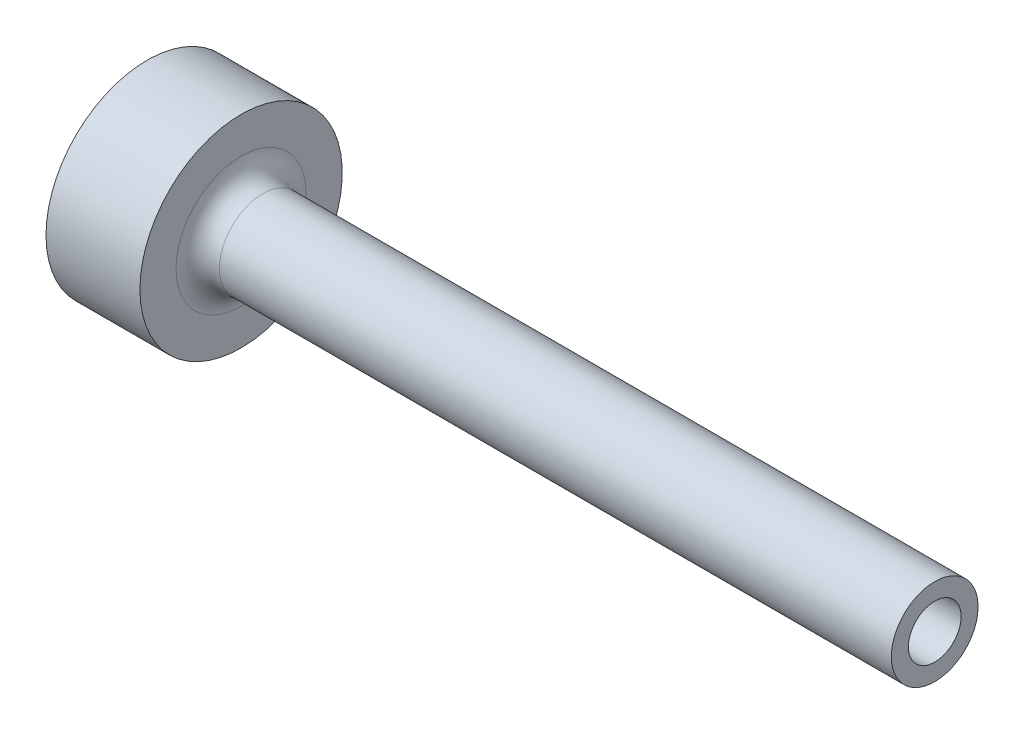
ISO-10303-21;
HEADER;
FILE_DESCRIPTION(('STEP AP214'),'2;1');
FILE_NAME('part.step','',(''),(''),'','','');
FILE_SCHEMA(('AUTOMOTIVE_DESIGN { 1 0 10303 214 1 1 1 1 }'));
ENDSEC;
DATA;
#1=APPLICATION_CONTEXT('core data for automotive mechanical design processes');
#2=APPLICATION_PROTOCOL_DEFINITION('international standard','automotive_design',2000,#1);
#3=PRODUCT_CONTEXT('',#1,'mechanical');
#4=PRODUCT('Part','Part','',(#3));
#5=PRODUCT_RELATED_PRODUCT_CATEGORY('part','',(#4));
#6=PRODUCT_DEFINITION_FORMATION('','',#4);
#7=PRODUCT_DEFINITION_CONTEXT('part definition',#1,'design');
#8=PRODUCT_DEFINITION('design','',#6,#7);
#9=PRODUCT_DEFINITION_SHAPE('','',#8);
#10=(LENGTH_UNIT() NAMED_UNIT(*) SI_UNIT(.MILLI.,.METRE.));
#11=(NAMED_UNIT(*) PLANE_ANGLE_UNIT() SI_UNIT($,.RADIAN.));
#12=(NAMED_UNIT(*) SI_UNIT($,.STERADIAN.) SOLID_ANGLE_UNIT());
#13=UNCERTAINTY_MEASURE_WITH_UNIT(LENGTH_MEASURE(1.E-05),#10,'distance_accuracy_value','');
#14=(GEOMETRIC_REPRESENTATION_CONTEXT(3) GLOBAL_UNCERTAINTY_ASSIGNED_CONTEXT((#13)) GLOBAL_UNIT_ASSIGNED_CONTEXT((#10,
#11,#12)) REPRESENTATION_CONTEXT('',''));
#15=CARTESIAN_POINT('',(0.,0.,0.));
#16=DIRECTION('',(0.,0.,1.));
#17=DIRECTION('',(1.,0.,0.));
#18=AXIS2_PLACEMENT_3D('',#15,#16,#17);
#19=CARTESIAN_POINT('',(0.,0.,0.));
#20=DIRECTION('',(-1.,0.,0.));
#21=DIRECTION('',(0.,0.,1.));
#22=AXIS2_PLACEMENT_3D('',#19,#20,#21);
#23=CYLINDRICAL_SURFACE('',#22,14.);
#24=CARTESIAN_POINT('',(13.,0.,0.));
#25=DIRECTION('',(-1.,0.,0.));
#26=DIRECTION('',(0.,0.,1.));
#27=AXIS2_PLACEMENT_3D('',#24,#25,#26);
#28=CIRCLE('',#27,14.);
#29=CARTESIAN_POINT('',(13.,0.,14.));
#30=VERTEX_POINT('',#29);
#31=EDGE_CURVE('E89',#30,#30,#28,.T.);
#32=ORIENTED_EDGE('',*,*,#31,.T.);
#33=EDGE_LOOP('',(#32));
#34=FACE_BOUND('',#33,.T.);
#35=CARTESIAN_POINT('',(0.,0.,0.));
#36=DIRECTION('',(-1.,0.,0.));
#37=DIRECTION('',(0.,0.,1.));
#38=AXIS2_PLACEMENT_3D('',#35,#36,#37);
#39=CIRCLE('',#38,14.);
#40=CARTESIAN_POINT('',(0.,0.,14.));
#41=VERTEX_POINT('',#40);
#42=EDGE_CURVE('E84',#41,#41,#39,.T.);
#43=ORIENTED_EDGE('',*,*,#42,.F.);
#44=EDGE_LOOP('',(#43));
#45=FACE_BOUND('',#44,.T.);
#46=CARTESIAN_POINT('',(6.5,-13.856406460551,-2.));
#47=CARTESIAN_POINT('',(6.61172417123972,-13.8564082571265,-1.99999534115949));
#48=CARTESIAN_POINT('',(6.72351471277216,-13.8577723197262,-1.99060664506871));
#49=CARTESIAN_POINT('',(6.9439746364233,-13.8630779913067,-1.95330740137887));
#50=CARTESIAN_POINT('',(7.05264079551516,-13.8670221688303,-1.92537839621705));
#51=CARTESIAN_POINT('',(7.26362870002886,-13.8770324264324,-1.85184738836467));
#52=CARTESIAN_POINT('',(7.36595507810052,-13.8830969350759,-1.80625847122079));
#53=CARTESIAN_POINT('',(7.56148972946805,-13.8966626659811,-1.69873175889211));
#54=CARTESIAN_POINT('',(7.65469934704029,-13.9041636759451,-1.63679637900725));
#55=CARTESIAN_POINT('',(7.83004829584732,-13.9198182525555,-1.49785346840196));
#56=CARTESIAN_POINT('',(7.91211171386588,-13.9279757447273,-1.42075056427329));
#57=CARTESIAN_POINT('',(8.06218155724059,-13.9439890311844,-1.25386707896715));
#58=CARTESIAN_POINT('',(8.13018723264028,-13.9518448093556,-1.16408582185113));
#59=CARTESIAN_POINT('',(8.25048909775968,-13.9664103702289,-0.973910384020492));
#60=CARTESIAN_POINT('',(8.30271571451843,-13.9731150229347,-0.873471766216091));
#61=CARTESIAN_POINT('',(8.38953073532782,-13.9845795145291,-0.665136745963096));
#62=CARTESIAN_POINT('',(8.4241199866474,-13.9893394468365,-0.557240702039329));
#63=CARTESIAN_POINT('',(8.47444920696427,-13.9963505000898,-0.337834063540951));
#64=CARTESIAN_POINT('',(8.49031606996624,-13.9986185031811,-0.226353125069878));
#65=CARTESIAN_POINT('',(8.5031438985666,-14.0004479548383,-0.00228956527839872));
#66=CARTESIAN_POINT('',(8.50010582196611,-14.0000095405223,0.110292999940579));
#67=CARTESIAN_POINT('',(8.47531062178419,-13.9964890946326,0.33249899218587));
#68=CARTESIAN_POINT('',(8.45369000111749,-13.9934263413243,0.442137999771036));
#69=CARTESIAN_POINT('',(8.39255744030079,-13.9850228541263,0.656215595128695));
#70=CARTESIAN_POINT('',(8.3530450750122,-13.9796820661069,0.760654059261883));
#71=CARTESIAN_POINT('',(8.25710925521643,-13.9672894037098,0.961781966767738));
#72=CARTESIAN_POINT('',(8.20062784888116,-13.9602316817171,1.05844339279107));
#73=CARTESIAN_POINT('',(8.07239950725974,-13.9451926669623,1.24096782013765));
#74=CARTESIAN_POINT('',(8.00065165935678,-13.9372113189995,1.32683017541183));
#75=CARTESIAN_POINT('',(7.843165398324,-13.921132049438,1.48612299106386));
#76=CARTESIAN_POINT('',(7.75730786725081,-13.9130337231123,1.55943569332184));
#77=CARTESIAN_POINT('',(7.57444547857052,-13.8977029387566,1.69062989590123));
#78=CARTESIAN_POINT('',(7.47744056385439,-13.890470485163,1.74851131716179));
#79=CARTESIAN_POINT('',(7.27491971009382,-13.8776905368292,1.84721301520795));
#80=CARTESIAN_POINT('',(7.1693981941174,-13.8721441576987,1.88802200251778));
#81=CARTESIAN_POINT('',(6.95290242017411,-13.8633846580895,1.9513062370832));
#82=CARTESIAN_POINT('',(6.84192850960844,-13.8601713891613,1.97378265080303));
#83=CARTESIAN_POINT('',(6.61872346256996,-13.8564698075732,1.99960390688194));
#84=CARTESIAN_POINT('',(6.50651197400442,-13.8559577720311,2.00311531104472));
#85=CARTESIAN_POINT('',(6.28310219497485,-13.8576537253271,1.9913480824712));
#86=CARTESIAN_POINT('',(6.17190387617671,-13.8598616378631,1.9760699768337));
#87=CARTESIAN_POINT('',(5.95418781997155,-13.8667269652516,1.92729837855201));
#88=CARTESIAN_POINT('',(5.84765127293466,-13.8713733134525,1.8938871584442));
#89=CARTESIAN_POINT('',(5.6416912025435,-13.8825829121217,1.80988306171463));
#90=CARTESIAN_POINT('',(5.54226800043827,-13.8891462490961,1.75928940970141));
#91=CARTESIAN_POINT('',(5.35260812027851,-13.9035064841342,1.64195360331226));
#92=CARTESIAN_POINT('',(5.26243903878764,-13.911311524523,1.57510320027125));
#93=CARTESIAN_POINT('',(5.09454027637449,-13.9272509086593,1.42730277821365));
#94=CARTESIAN_POINT('',(5.01681123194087,-13.9353852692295,1.34635203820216));
#95=CARTESIAN_POINT('',(4.8754047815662,-13.9511405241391,1.17191708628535));
#96=CARTESIAN_POINT('',(4.81183747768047,-13.9587570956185,1.07834317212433));
#97=CARTESIAN_POINT('',(4.70132443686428,-13.972552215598,0.881748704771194));
#98=CARTESIAN_POINT('',(4.65437828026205,-13.9787308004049,0.778728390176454));
#99=CARTESIAN_POINT('',(4.57861788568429,-13.9889347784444,0.566515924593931));
#100=CARTESIAN_POINT('',(4.54974241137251,-13.9929674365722,0.457345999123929));
#101=CARTESIAN_POINT('',(4.51074453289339,-13.9984555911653,0.235645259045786));
#102=CARTESIAN_POINT('',(4.50062101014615,-13.9999112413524,0.123114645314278));
#103=CARTESIAN_POINT('',(4.49943976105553,-14.0000800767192,-0.101043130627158));
#104=CARTESIAN_POINT('',(4.50821318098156,-13.998817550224,-0.212669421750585));
#105=CARTESIAN_POINT('',(4.54421615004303,-13.9937406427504,-0.432842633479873));
#106=CARTESIAN_POINT('',(4.57144565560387,-13.989926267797,-0.541389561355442));
#107=CARTESIAN_POINT('',(4.6435299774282,-13.9801722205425,-0.752283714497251));
#108=CARTESIAN_POINT('',(4.68837418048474,-13.9742338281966,-0.854634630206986));
#109=CARTESIAN_POINT('',(4.79439714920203,-13.960885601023,-1.05038570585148));
#110=CARTESIAN_POINT('',(4.8555763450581,-13.9534757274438,-1.14378562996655));
#111=CARTESIAN_POINT('',(4.99314771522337,-13.9379304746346,-1.31984194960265));
#112=CARTESIAN_POINT('',(5.06966490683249,-13.9297894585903,-1.40240016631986));
#113=CARTESIAN_POINT('',(5.2354775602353,-13.9137422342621,-1.55356716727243));
#114=CARTESIAN_POINT('',(5.32477602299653,-13.9058360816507,-1.6221726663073));
#115=CARTESIAN_POINT('',(5.51414543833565,-13.8911108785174,-1.74379523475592));
#116=CARTESIAN_POINT('',(5.61426869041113,-13.8842975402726,-1.79673154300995));
#117=CARTESIAN_POINT('',(5.82203229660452,-13.8725962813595,-1.88495902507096));
#118=CARTESIAN_POINT('',(5.92966459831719,-13.8677063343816,-1.92026877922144));
#119=CARTESIAN_POINT('',(6.11483642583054,-13.8615529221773,-1.96409255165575));
#120=CARTESIAN_POINT('',(6.19122433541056,-13.859633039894,-1.97753762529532));
#121=CARTESIAN_POINT('',(6.34506419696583,-13.857059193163,-1.99549291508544));
#122=CARTESIAN_POINT('',(6.42251613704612,-13.8564052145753,-2.00000323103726));
#123=CARTESIAN_POINT('',(6.5,-13.856406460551,-2.));
#124=B_SPLINE_CURVE_WITH_KNOTS('',3,(#46,#47,#48,#49,#50,#51,#52,#53,#54,#55,#56,#57,#58,#59,
#60,#61,#62,#63,#64,#65,#66,#67,#68,#69,#70,#71,#72,#73,#74,#75,#76,#77,#78,#79,#80,#81,#82,#83,
#84,#85,#86,#87,#88,#89,#90,#91,#92,#93,#94,#95,#96,#97,#98,#99,#100,#101,#102,#103,#104,#105,
#106,#107,#108,#109,#110,#111,#112,#113,#114,#115,#116,#117,#118,#119,#120,#121,#122,#123),
.UNSPECIFIED.,.T.,.F.,(4,2,2,2,2,2,2,2,2,2,2,2,2,2,2,2,2,2,2,2,2,2,2,2,2,2,2,2,2,2,2,2,2,2,2,2,
2,2,4),(0.,0.334889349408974,0.670112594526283,1.00508792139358,1.34001378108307,
1.6771171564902,2.01423851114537,2.35282530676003,2.6913958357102,3.02765822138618,
3.36390357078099,3.69769984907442,4.03150405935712,4.36646147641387,4.70143892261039,
5.03940517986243,5.37737316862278,5.7155642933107,6.05373389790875,6.3889286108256,
6.72411392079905,7.05779100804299,7.39148315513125,7.72746121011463,8.06345644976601,
8.40197921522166,8.74049343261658,9.07785422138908,9.41519488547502,9.74953375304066,
10.083871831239,10.4180087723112,10.7521545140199,11.0891434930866,11.426211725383,
11.7649881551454,12.103406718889,12.3356645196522,12.5679197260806),.UNSPECIFIED.);
#125=CARTESIAN_POINT('',(6.5,-13.856406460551,-2.));
#126=VERTEX_POINT('',#125);
#127=EDGE_CURVE('E10',#126,#126,#124,.T.);
#128=ORIENTED_EDGE('',*,*,#127,.F.);
#129=EDGE_LOOP('',(#128));
#130=FACE_BOUND('',#129,.T.);
#131=ADVANCED_FACE('F16',(#34,#45,#130),#23,.T.);
#132=CARTESIAN_POINT('',(0.,0.,0.));
#133=DIRECTION('',(1.,0.,0.));
#134=DIRECTION('',(0.,0.,-1.));
#135=AXIS2_PLACEMENT_3D('',#132,#133,#134);
#136=CONICAL_SURFACE('',#135,1.75,0.0174532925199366);
#137=CARTESIAN_POINT('',(109.,0.,0.));
#138=DIRECTION('',(-1.,0.,0.));
#139=DIRECTION('',(0.,0.,1.));
#140=AXIS2_PLACEMENT_3D('',#137,#138,#139);
#141=CIRCLE('',#140,3.65260207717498);
#142=CARTESIAN_POINT('',(109.,0.,3.65260207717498));
#143=VERTEX_POINT('',#142);
#144=EDGE_CURVE('E81',#143,#143,#141,.T.);
#145=ORIENTED_EDGE('',*,*,#144,.F.);
#146=EDGE_LOOP('',(#145));
#147=FACE_BOUND('',#146,.T.);
#148=CARTESIAN_POINT('',(1.08679639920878,0.,0.));
#149=DIRECTION('',(-1.,0.,0.));
#150=DIRECTION('',(0.,0.,1.));
#151=AXIS2_PLACEMENT_3D('',#148,#149,#150);
#152=CIRCLE('',#151,1.76897010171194);
#153=CARTESIAN_POINT('',(1.08679639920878,0.,1.76897010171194));
#154=VERTEX_POINT('',#153);
#155=EDGE_CURVE('E94',#154,#154,#152,.F.);
#156=ORIENTED_EDGE('',*,*,#155,.F.);
#157=EDGE_LOOP('',(#156));
#158=FACE_BOUND('',#157,.T.);
#159=ADVANCED_FACE('F45',(#147,#158),#136,.F.);
#160=CARTESIAN_POINT('',(16.,0.,0.));
#161=DIRECTION('',(-1.,0.,0.));
#162=DIRECTION('',(0.,0.,1.));
#163=AXIS2_PLACEMENT_3D('',#160,#161,#162);
#164=TOROIDAL_SURFACE('',#163,9.,3.);
#165=CARTESIAN_POINT('',(13.,0.,0.));
#166=DIRECTION('',(-1.,0.,0.));
#167=DIRECTION('',(0.,0.,1.));
#168=AXIS2_PLACEMENT_3D('',#165,#166,#167);
#169=CIRCLE('',#168,9.);
#170=CARTESIAN_POINT('',(13.,0.,9.));
#171=VERTEX_POINT('',#170);
#172=EDGE_CURVE('E91',#171,#171,#169,.T.);
#173=ORIENTED_EDGE('',*,*,#172,.F.);
#174=EDGE_LOOP('',(#173));
#175=FACE_BOUND('',#174,.T.);
#176=CARTESIAN_POINT('',(16.,0.,0.));
#177=DIRECTION('',(-1.,0.,0.));
#178=DIRECTION('',(0.,0.,1.));
#179=AXIS2_PLACEMENT_3D('',#176,#177,#178);
#180=CIRCLE('',#179,6.);
#181=CARTESIAN_POINT('',(16.,0.,6.));
#182=VERTEX_POINT('',#181);
#183=EDGE_CURVE('E28',#182,#182,#180,.T.);
#184=ORIENTED_EDGE('',*,*,#183,.T.);
#185=EDGE_LOOP('',(#184));
#186=FACE_BOUND('',#185,.T.);
#187=ADVANCED_FACE('F18',(#175,#186),#164,.F.);
#188=CARTESIAN_POINT('',(0.,0.,0.));
#189=DIRECTION('',(-1.,0.,0.));
#190=DIRECTION('',(0.,0.,1.));
#191=AXIS2_PLACEMENT_3D('',#188,#189,#190);
#192=CYLINDRICAL_SURFACE('',#191,6.);
#193=ORIENTED_EDGE('',*,*,#183,.F.);
#194=EDGE_LOOP('',(#193));
#195=FACE_BOUND('',#194,.T.);
#196=CARTESIAN_POINT('',(109.,0.,0.));
#197=DIRECTION('',(-1.,0.,0.));
#198=DIRECTION('',(0.,0.,1.));
#199=AXIS2_PLACEMENT_3D('',#196,#197,#198);
#200=CIRCLE('',#199,6.);
#201=CARTESIAN_POINT('',(109.,0.,6.));
#202=VERTEX_POINT('',#201);
#203=EDGE_CURVE('E80',#202,#202,#200,.T.);
#204=ORIENTED_EDGE('',*,*,#203,.T.);
#205=EDGE_LOOP('',(#204));
#206=FACE_BOUND('',#205,.T.);
#207=ADVANCED_FACE('F66',(#195,#206),#192,.T.);
#208=CARTESIAN_POINT('',(109.,6.,0.));
#209=DIRECTION('',(-1.,0.,0.));
#210=DIRECTION('',(0.,0.,1.));
#211=AXIS2_PLACEMENT_3D('',#208,#209,#210);
#212=PLANE('',#211);
#213=ORIENTED_EDGE('',*,*,#203,.F.);
#214=EDGE_LOOP('',(#213));
#215=FACE_BOUND('',#214,.T.);
#216=ORIENTED_EDGE('',*,*,#144,.T.);
#217=EDGE_LOOP('',(#216));
#218=FACE_BOUND('',#217,.T.);
#219=ADVANCED_FACE('F62',(#215,#218),#212,.F.);
#220=CARTESIAN_POINT('',(0.,1.75,0.));
#221=DIRECTION('',(1.,0.,0.));
#222=DIRECTION('',(0.,0.,-1.));
#223=AXIS2_PLACEMENT_3D('',#220,#221,#222);
#224=PLANE('',#223);
#225=CARTESIAN_POINT('',(0.,0.,0.));
#226=DIRECTION('',(-1.,0.,0.));
#227=DIRECTION('',(0.,0.,1.));
#228=AXIS2_PLACEMENT_3D('',#225,#226,#227);
#229=CIRCLE('',#228,5.);
#230=CARTESIAN_POINT('',(0.,0.,5.));
#231=VERTEX_POINT('',#230);
#232=EDGE_CURVE('E97',#231,#231,#229,.T.);
#233=ORIENTED_EDGE('',*,*,#232,.F.);
#234=EDGE_LOOP('',(#233));
#235=FACE_BOUND('',#234,.T.);
#236=ORIENTED_EDGE('',*,*,#42,.T.);
#237=EDGE_LOOP('',(#236));
#238=FACE_BOUND('',#237,.T.);
#239=ADVANCED_FACE('F60',(#235,#238),#224,.F.);
#240=CARTESIAN_POINT('',(13.,14.,0.));
#241=DIRECTION('',(-1.,0.,0.));
#242=DIRECTION('',(0.,0.,1.));
#243=AXIS2_PLACEMENT_3D('',#240,#241,#242);
#244=PLANE('',#243);
#245=ORIENTED_EDGE('',*,*,#31,.F.);
#246=EDGE_LOOP('',(#245));
#247=FACE_BOUND('',#246,.T.);
#248=ORIENTED_EDGE('',*,*,#172,.T.);
#249=EDGE_LOOP('',(#248));
#250=FACE_BOUND('',#249,.T.);
#251=ADVANCED_FACE('F58',(#247,#250),#244,.F.);
#252=CARTESIAN_POINT('',(-37.3349076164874,0.,0.));
#253=DIRECTION('',(-1.,0.,0.));
#254=DIRECTION('',(0.,0.,1.));
#255=AXIS2_PLACEMENT_3D('',#252,#253,#254);
#256=DEGENERATE_TOROIDAL_SURFACE('',#255,9.35634609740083,40.,.F.);
#257=ORIENTED_EDGE('',*,*,#232,.T.);
#258=EDGE_LOOP('',(#257));
#259=FACE_BOUND('',#258,.T.);
#260=ORIENTED_EDGE('',*,*,#155,.T.);
#261=EDGE_LOOP('',(#260));
#262=FACE_BOUND('',#261,.T.);
#263=ADVANCED_FACE('F41',(#259,#262),#256,.T.);
#264=CARTESIAN_POINT('',(6.5,-14.,0.));
#265=DIRECTION('',(0.,-1.,0.));
#266=DIRECTION('',(0.,0.,-1.));
#267=AXIS2_PLACEMENT_3D('',#264,#265,#266);
#268=CYLINDRICAL_SURFACE('',#267,2.);
#269=CARTESIAN_POINT('',(6.5,-8.,0.));
#270=DIRECTION('',(0.,-1.,0.));
#271=DIRECTION('',(0.,0.,-1.));
#272=AXIS2_PLACEMENT_3D('',#269,#270,#271);
#273=CIRCLE('',#272,2.);
#274=CARTESIAN_POINT('',(6.5,-8.,-2.));
#275=VERTEX_POINT('',#274);
#276=EDGE_CURVE('E100',#275,#275,#273,.T.);
#277=ORIENTED_EDGE('',*,*,#276,.F.);
#278=EDGE_LOOP('',(#277));
#279=FACE_BOUND('',#278,.T.);
#280=ORIENTED_EDGE('',*,*,#127,.T.);
#281=EDGE_LOOP('',(#280));
#282=FACE_BOUND('',#281,.T.);
#283=ADVANCED_FACE('F33',(#279,#282),#268,.F.);
#284=CARTESIAN_POINT('',(6.5,-6.84529946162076,0.));
#285=DIRECTION('',(0.,-1.,0.));
#286=DIRECTION('',(0.,0.,-1.));
#287=AXIS2_PLACEMENT_3D('',#284,#285,#286);
#288=CONICAL_SURFACE('',#287,0.,1.0471975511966);
#289=ORIENTED_EDGE('',*,*,#276,.T.);
#290=EDGE_LOOP('',(#289));
#291=FACE_BOUND('',#290,.T.);
#292=CARTESIAN_POINT('',(6.5,-6.84529946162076,0.));
#293=VERTEX_POINT('',#292);
#294=VERTEX_LOOP('',#293);
#295=FACE_BOUND('',#294,.T.);
#296=ADVANCED_FACE('F31',(#291,#295),#288,.F.);
#297=CLOSED_SHELL('',(#131,#159,#187,#207,#219,#239,#251,#263,#283,#296));
#298=MANIFOLD_SOLID_BREP('B1',#297);
#299=ADVANCED_BREP_SHAPE_REPRESENTATION('',(#18,#298),#14);
#300=SHAPE_DEFINITION_REPRESENTATION(#9,#299);
ENDSEC;
END-ISO-10303-21;
